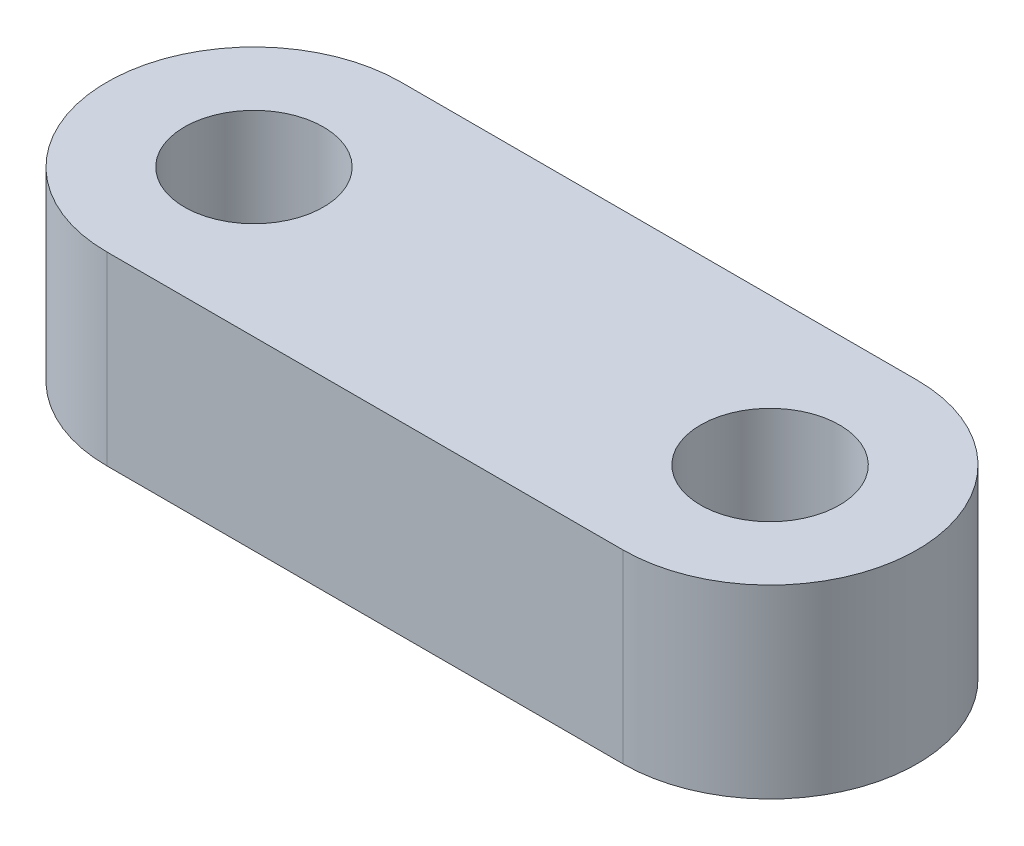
ISO-10303-21;
HEADER;
FILE_DESCRIPTION(('STEP AP214'),'2;1');
FILE_NAME('part.step','',(''),(''),'','','');
FILE_SCHEMA(('AUTOMOTIVE_DESIGN { 1 0 10303 214 1 1 1 1 }'));
ENDSEC;
DATA;
#1=APPLICATION_CONTEXT('core data for automotive mechanical design processes');
#2=APPLICATION_PROTOCOL_DEFINITION('international standard','automotive_design',2000,#1);
#3=PRODUCT_CONTEXT('',#1,'mechanical');
#4=PRODUCT('Part','Part','',(#3));
#5=PRODUCT_RELATED_PRODUCT_CATEGORY('part','',(#4));
#6=PRODUCT_DEFINITION_FORMATION('','',#4);
#7=PRODUCT_DEFINITION_CONTEXT('part definition',#1,'design');
#8=PRODUCT_DEFINITION('design','',#6,#7);
#9=PRODUCT_DEFINITION_SHAPE('','',#8);
#10=(LENGTH_UNIT() NAMED_UNIT(*) SI_UNIT(.MILLI.,.METRE.));
#11=(NAMED_UNIT(*) PLANE_ANGLE_UNIT() SI_UNIT($,.RADIAN.));
#12=(NAMED_UNIT(*) SI_UNIT($,.STERADIAN.) SOLID_ANGLE_UNIT());
#13=UNCERTAINTY_MEASURE_WITH_UNIT(LENGTH_MEASURE(1.E-05),#10,'distance_accuracy_value','');
#14=(GEOMETRIC_REPRESENTATION_CONTEXT(3) GLOBAL_UNCERTAINTY_ASSIGNED_CONTEXT((#13)) GLOBAL_UNIT_ASSIGNED_CONTEXT((#10,
#11,#12)) REPRESENTATION_CONTEXT('',''));
#15=CARTESIAN_POINT('',(0.,0.,0.));
#16=DIRECTION('',(0.,0.,1.));
#17=DIRECTION('',(1.,0.,0.));
#18=AXIS2_PLACEMENT_3D('',#15,#16,#17);
#19=CARTESIAN_POINT('',(11.14266342,0.,0.));
#20=DIRECTION('',(0.,1.,0.));
#21=DIRECTION('',(-1.,0.,0.));
#22=AXIS2_PLACEMENT_3D('',#19,#20,#21);
#23=CYLINDRICAL_SURFACE('',#22,1.50000000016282);
#24=CARTESIAN_POINT('',(11.14266342,2.,0.));
#25=DIRECTION('',(0.,1.,0.));
#26=DIRECTION('',(-1.,0.,0.));
#27=AXIS2_PLACEMENT_3D('',#24,#25,#26);
#28=CIRCLE('',#27,1.50000000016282);
#29=CARTESIAN_POINT('',(9.64266341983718,2.,0.));
#30=VERTEX_POINT('',#29);
#31=EDGE_CURVE('E89',#30,#30,#28,.T.);
#32=ORIENTED_EDGE('',*,*,#31,.T.);
#33=EDGE_LOOP('',(#32));
#34=FACE_BOUND('',#33,.T.);
#35=CARTESIAN_POINT('',(11.14266342,-2.,0.));
#36=DIRECTION('',(0.,1.,0.));
#37=DIRECTION('',(-1.,0.,0.));
#38=AXIS2_PLACEMENT_3D('',#35,#36,#37);
#39=CIRCLE('',#38,1.50000000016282);
#40=CARTESIAN_POINT('',(9.64266341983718,-2.,0.));
#41=VERTEX_POINT('',#40);
#42=EDGE_CURVE('E18',#41,#41,#39,.T.);
#43=ORIENTED_EDGE('',*,*,#42,.F.);
#44=EDGE_LOOP('',(#43));
#45=FACE_BOUND('',#44,.T.);
#46=ADVANCED_FACE('F14',(#34,#45),#23,.F.);
#47=CARTESIAN_POINT('',(0.,0.,3.175));
#48=DIRECTION('',(0.,0.,-1.));
#49=DIRECTION('',(1.,0.,0.));
#50=AXIS2_PLACEMENT_3D('',#47,#48,#49);
#51=PLANE('',#50);
#52=DIRECTION('',(0.,1.,0.));
#53=VECTOR('',#52,1.);
#54=CARTESIAN_POINT('',(0.,0.,3.175));
#55=LINE('',#54,#53);
#56=CARTESIAN_POINT('',(0.,-2.,3.175));
#57=VERTEX_POINT('',#56);
#58=CARTESIAN_POINT('',(0.,2.,3.175));
#59=VERTEX_POINT('',#58);
#60=EDGE_CURVE('E59',#57,#59,#55,.T.);
#61=ORIENTED_EDGE('',*,*,#60,.F.);
#62=DIRECTION('',(1.,0.,0.));
#63=VECTOR('',#62,1.);
#64=CARTESIAN_POINT('',(0.,-2.,3.175));
#65=LINE('',#64,#63);
#66=CARTESIAN_POINT('',(11.14266342,-2.,3.175));
#67=VERTEX_POINT('',#66);
#68=EDGE_CURVE('E63',#67,#57,#65,.F.);
#69=ORIENTED_EDGE('',*,*,#68,.F.);
#70=DIRECTION('',(0.,1.,0.));
#71=VECTOR('',#70,1.);
#72=CARTESIAN_POINT('',(11.14266342,0.,3.175));
#73=LINE('',#72,#71);
#74=CARTESIAN_POINT('',(11.14266342,2.,3.175));
#75=VERTEX_POINT('',#74);
#76=EDGE_CURVE('E90',#75,#67,#73,.F.);
#77=ORIENTED_EDGE('',*,*,#76,.F.);
#78=DIRECTION('',(1.,0.,0.));
#79=VECTOR('',#78,1.);
#80=CARTESIAN_POINT('',(11.14266342,2.,3.175));
#81=LINE('',#80,#79);
#82=EDGE_CURVE('E65',#75,#59,#81,.F.);
#83=ORIENTED_EDGE('',*,*,#82,.T.);
#84=EDGE_LOOP('',(#61,#69,#77,#83));
#85=FACE_BOUND('',#84,.T.);
#86=ADVANCED_FACE('F60',(#85),#51,.F.);
#87=CARTESIAN_POINT('',(0.,0.,0.));
#88=DIRECTION('',(0.,1.,0.));
#89=DIRECTION('',(-1.,0.,0.));
#90=AXIS2_PLACEMENT_3D('',#87,#88,#89);
#91=CYLINDRICAL_SURFACE('',#90,3.175);
#92=CARTESIAN_POINT('',(0.,2.,0.));
#93=DIRECTION('',(0.,1.,0.));
#94=DIRECTION('',(-1.,0.,0.));
#95=AXIS2_PLACEMENT_3D('',#92,#93,#94);
#96=CIRCLE('',#95,3.175);
#97=CARTESIAN_POINT('',(0.,2.,-3.175));
#98=VERTEX_POINT('',#97);
#99=EDGE_CURVE('E99',#59,#98,#96,.F.);
#100=ORIENTED_EDGE('',*,*,#99,.T.);
#101=DIRECTION('',(0.,-1.,0.));
#102=VECTOR('',#101,1.);
#103=CARTESIAN_POINT('',(0.,0.,-3.175));
#104=LINE('',#103,#102);
#105=CARTESIAN_POINT('',(0.,-2.,-3.175));
#106=VERTEX_POINT('',#105);
#107=EDGE_CURVE('E53',#98,#106,#104,.T.);
#108=ORIENTED_EDGE('',*,*,#107,.T.);
#109=CARTESIAN_POINT('',(0.,-2.,0.));
#110=DIRECTION('',(0.,1.,0.));
#111=DIRECTION('',(-1.,0.,0.));
#112=AXIS2_PLACEMENT_3D('',#109,#110,#111);
#113=CIRCLE('',#112,3.175);
#114=EDGE_CURVE('E69',#106,#57,#113,.T.);
#115=ORIENTED_EDGE('',*,*,#114,.T.);
#116=ORIENTED_EDGE('',*,*,#60,.T.);
#117=EDGE_LOOP('',(#100,#108,#115,#116));
#118=FACE_BOUND('',#117,.T.);
#119=ADVANCED_FACE('F70',(#118),#91,.T.);
#120=CARTESIAN_POINT('',(11.14266342,0.,-3.175));
#121=DIRECTION('',(0.,0.,1.));
#122=DIRECTION('',(0.,-1.,0.));
#123=AXIS2_PLACEMENT_3D('',#120,#121,#122);
#124=PLANE('',#123);
#125=DIRECTION('',(0.,1.,0.));
#126=VECTOR('',#125,1.);
#127=CARTESIAN_POINT('',(11.14266342,0.,-3.175));
#128=LINE('',#127,#126);
#129=CARTESIAN_POINT('',(11.14266342,-2.,-3.175));
#130=VERTEX_POINT('',#129);
#131=CARTESIAN_POINT('',(11.14266342,2.,-3.175));
#132=VERTEX_POINT('',#131);
#133=EDGE_CURVE('E33',#130,#132,#128,.T.);
#134=ORIENTED_EDGE('',*,*,#133,.F.);
#135=DIRECTION('',(1.,0.,0.));
#136=VECTOR('',#135,1.);
#137=CARTESIAN_POINT('',(11.14266342,-2.,-3.175));
#138=LINE('',#137,#136);
#139=EDGE_CURVE('E74',#106,#130,#138,.T.);
#140=ORIENTED_EDGE('',*,*,#139,.F.);
#141=ORIENTED_EDGE('',*,*,#107,.F.);
#142=DIRECTION('',(1.,0.,0.));
#143=VECTOR('',#142,1.);
#144=CARTESIAN_POINT('',(11.14266342,2.,-3.175));
#145=LINE('',#144,#143);
#146=EDGE_CURVE('E88',#98,#132,#145,.T.);
#147=ORIENTED_EDGE('',*,*,#146,.T.);
#148=EDGE_LOOP('',(#134,#140,#141,#147));
#149=FACE_BOUND('',#148,.T.);
#150=ADVANCED_FACE('F85',(#149),#124,.F.);
#151=CARTESIAN_POINT('',(11.14266342,0.,0.));
#152=DIRECTION('',(0.,1.,0.));
#153=DIRECTION('',(-1.,0.,0.));
#154=AXIS2_PLACEMENT_3D('',#151,#152,#153);
#155=CYLINDRICAL_SURFACE('',#154,3.175);
#156=ORIENTED_EDGE('',*,*,#76,.T.);
#157=CARTESIAN_POINT('',(11.14266342,-2.,0.));
#158=DIRECTION('',(0.,1.,0.));
#159=DIRECTION('',(-1.,0.,0.));
#160=AXIS2_PLACEMENT_3D('',#157,#158,#159);
#161=CIRCLE('',#160,3.175);
#162=EDGE_CURVE('E76',#67,#130,#161,.T.);
#163=ORIENTED_EDGE('',*,*,#162,.T.);
#164=ORIENTED_EDGE('',*,*,#133,.T.);
#165=CARTESIAN_POINT('',(11.14266342,2.,0.));
#166=DIRECTION('',(0.,1.,0.));
#167=DIRECTION('',(-1.,0.,0.));
#168=AXIS2_PLACEMENT_3D('',#165,#166,#167);
#169=CIRCLE('',#168,3.175);
#170=EDGE_CURVE('E24',#132,#75,#169,.F.);
#171=ORIENTED_EDGE('',*,*,#170,.T.);
#172=EDGE_LOOP('',(#156,#163,#164,#171));
#173=FACE_BOUND('',#172,.T.);
#174=ADVANCED_FACE('F103',(#173),#155,.T.);
#175=CARTESIAN_POINT('',(0.,0.,0.));
#176=DIRECTION('',(0.,1.,0.));
#177=DIRECTION('',(-1.,0.,0.));
#178=AXIS2_PLACEMENT_3D('',#175,#176,#177);
#179=CYLINDRICAL_SURFACE('',#178,1.5);
#180=CARTESIAN_POINT('',(0.,2.,0.));
#181=DIRECTION('',(0.,1.,0.));
#182=DIRECTION('',(-1.,0.,0.));
#183=AXIS2_PLACEMENT_3D('',#180,#181,#182);
#184=CIRCLE('',#183,1.5);
#185=CARTESIAN_POINT('',(-1.5,2.,0.));
#186=VERTEX_POINT('',#185);
#187=EDGE_CURVE('E9',#186,#186,#184,.T.);
#188=ORIENTED_EDGE('',*,*,#187,.T.);
#189=EDGE_LOOP('',(#188));
#190=FACE_BOUND('',#189,.T.);
#191=CARTESIAN_POINT('',(0.,-2.,0.));
#192=DIRECTION('',(0.,1.,0.));
#193=DIRECTION('',(-1.,0.,0.));
#194=AXIS2_PLACEMENT_3D('',#191,#192,#193);
#195=CIRCLE('',#194,1.5);
#196=CARTESIAN_POINT('',(-1.5,-2.,0.));
#197=VERTEX_POINT('',#196);
#198=EDGE_CURVE('E67',#197,#197,#195,.T.);
#199=ORIENTED_EDGE('',*,*,#198,.F.);
#200=EDGE_LOOP('',(#199));
#201=FACE_BOUND('',#200,.T.);
#202=ADVANCED_FACE('F105',(#190,#201),#179,.F.);
#203=CARTESIAN_POINT('',(11.14266342,2.,0.));
#204=DIRECTION('',(0.,-1.,0.));
#205=DIRECTION('',(1.,0.,0.));
#206=AXIS2_PLACEMENT_3D('',#203,#204,#205);
#207=PLANE('',#206);
#208=ORIENTED_EDGE('',*,*,#187,.F.);
#209=EDGE_LOOP('',(#208));
#210=FACE_BOUND('',#209,.T.);
#211=ORIENTED_EDGE('',*,*,#146,.F.);
#212=ORIENTED_EDGE('',*,*,#99,.F.);
#213=ORIENTED_EDGE('',*,*,#82,.F.);
#214=ORIENTED_EDGE('',*,*,#170,.F.);
#215=EDGE_LOOP('',(#211,#212,#213,#214));
#216=FACE_BOUND('',#215,.T.);
#217=ORIENTED_EDGE('',*,*,#31,.F.);
#218=EDGE_LOOP('',(#217));
#219=FACE_BOUND('',#218,.T.);
#220=ADVANCED_FACE('F101',(#210,#216,#219),#207,.F.);
#221=CARTESIAN_POINT('',(11.14266342,-2.,0.));
#222=DIRECTION('',(0.,-1.,0.));
#223=DIRECTION('',(1.,0.,0.));
#224=AXIS2_PLACEMENT_3D('',#221,#222,#223);
#225=PLANE('',#224);
#226=ORIENTED_EDGE('',*,*,#198,.T.);
#227=EDGE_LOOP('',(#226));
#228=FACE_BOUND('',#227,.T.);
#229=ORIENTED_EDGE('',*,*,#114,.F.);
#230=ORIENTED_EDGE('',*,*,#139,.T.);
#231=ORIENTED_EDGE('',*,*,#162,.F.);
#232=ORIENTED_EDGE('',*,*,#68,.T.);
#233=EDGE_LOOP('',(#229,#230,#231,#232));
#234=FACE_BOUND('',#233,.T.);
#235=ORIENTED_EDGE('',*,*,#42,.T.);
#236=EDGE_LOOP('',(#235));
#237=FACE_BOUND('',#236,.T.);
#238=ADVANCED_FACE('F16',(#228,#234,#237),#225,.T.);
#239=CLOSED_SHELL('',(#46,#86,#119,#150,#174,#202,#220,#238));
#240=MANIFOLD_SOLID_BREP('B1',#239);
#241=ADVANCED_BREP_SHAPE_REPRESENTATION('',(#18,#240),#14);
#242=SHAPE_DEFINITION_REPRESENTATION(#9,#241);
ENDSEC;
END-ISO-10303-21;
